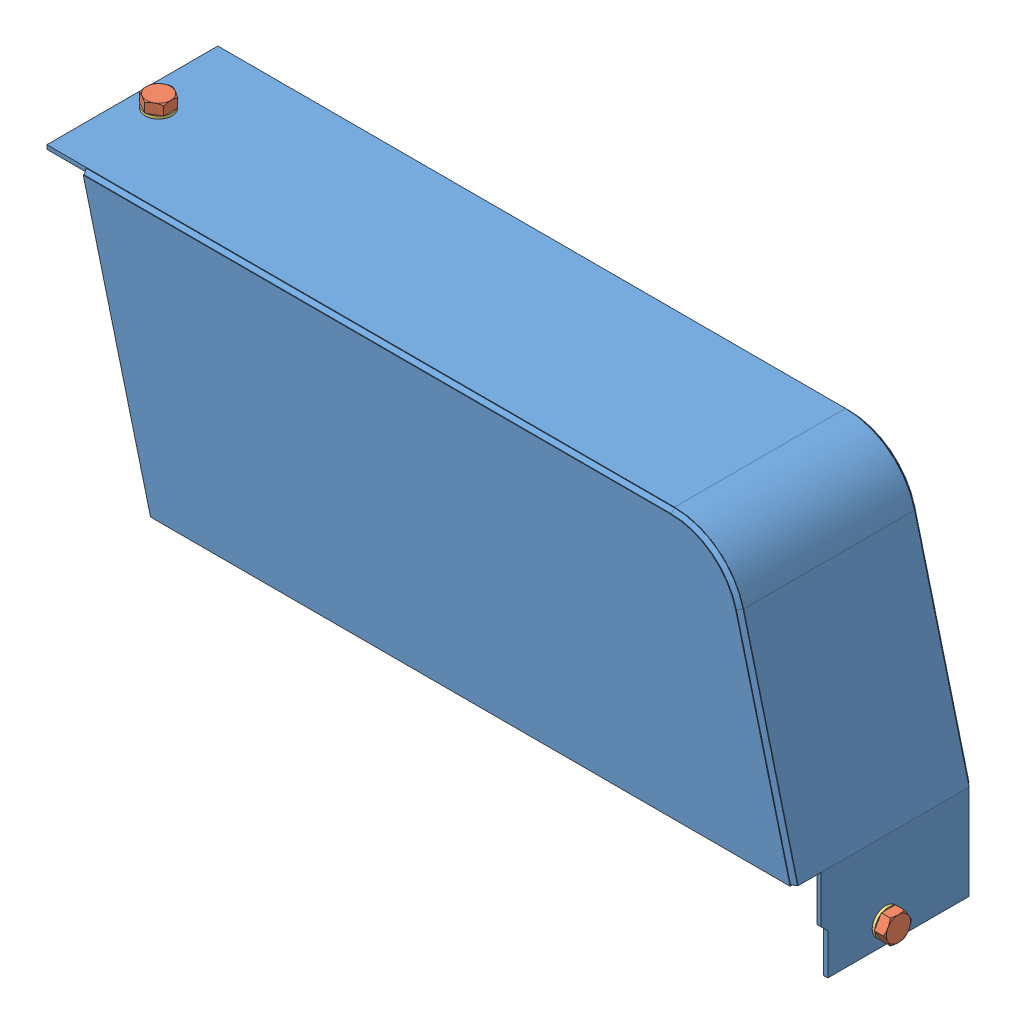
SolidWorks assembly 144 SYM - carter droit - bande de frein avec vis.SLDASM, configuration Default (file format 3100). Lengths in mm.
Overall size (567.5 277.5 133).
7 component instances, 3 part files, 6 mates.
Components (placement in the parent):
- 144 SYM - carter droit - bande de frein-1: 144 SYM - carter droit - bande de frein.SLDPRT [Default<Brut d'usinage>] at (-78.7713 3.5197 39.1753) size (558 268 133)
- vis HM12 avec W12-1: vis HM12 avec W12.SLDASM [Default] at (-513.8122 48.4178 -220.083) x (0.5 0 0.866025) z (0 -1 0) size (20 20.78 32.5)
  - VisHM12x25-1: VisHM12x25.SLDPRT [Défaut] at (0.3465 5.4562 -12.6397) size (18 20.78 32.5)
  - Rondelle_grower W12-1: Rondelle_grower W12.SLDPRT [Défaut] at (0.3465 5.4562 -12.6397) x (0 0 1) z (-1 0 0) size (2 20 20)
- vis HM12 avec W12-2: vis HM12 avec W12.SLDASM [Default] at (10.9961 -198.841 -214.6268) x (0 0.5 0.866025) z (-1 0 0) size (20 20.78 32.5)
  - VisHM12x25-1: VisHM12x25.SLDPRT [Défaut] at (0.3465 5.4562 -12.6397) size (18 20.78 32.5)
  - Rondelle_grower W12-1: Rondelle_grower W12.SLDPRT [Défaut] at (0.3465 5.4562 -12.6397) x (0 0 1) z (-1 0 0) size (2 20 20)
Mates (geometry in assembly coordinates):
- Coaxiale1: concentric anti-aligned: cylinder of 144 SYM - carter droit - bande de frein-1; cylinder of vis HM12 avec W12-1/VisHM12x25-1
- Coïncidente1: coincident anti-aligned: plane of 144 SYM - carter droit - bande de frein-1 through (-536.3641 59.0575 -279.0548) normal (0 1 0); plane of vis HM12 avec W12-1/Rondelle_grower W12-1 through (-513.3641 59.0575 -208.3945) normal (0 -1 0)
- Parallèle1: parallel aligned: plane of 144 SYM - carter droit - bande de frein-1 through (-536.3641 59.0575 -279.0548) normal (-1 0 0); plane of vis HM12 avec W12-1/VisHM12x25-1 through (-527.3641 68.5575 -222.2509) normal (-1 0 0)
- Coaxiale2: concentric: cylinder of 144 SYM - carter droit - bande de frein-1; cylinder of ?
- Coïncidente3: coincident: plane of 144 SYM - carter droit - bande de frein-1 through (21.6359 -138.564 -279.0548) normal (1 0 0); plane of ? through (21.6359 -186.1269 -210.8165) normal (-1 0 0)
- Parallèle2: parallel aligned: plane of 144 SYM - carter droit - bande de frein-1; plane of ?
